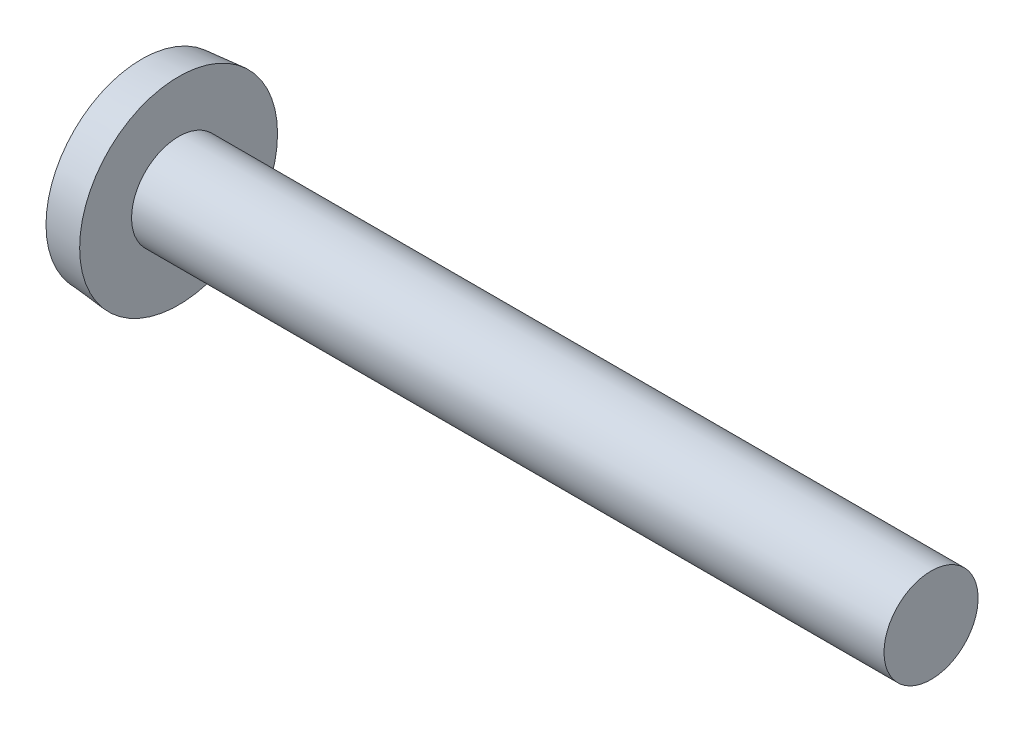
from build123d import *

# Parameters (mm, degrees)
CIRPATTERN1_COUNT = 2
CIRPATTERN1_ANGLE = 90


with BuildPart() as part:
    # BodySke → Base-Revolve (revolve)
    with BuildSketch(Plane.XY, mode=Mode.PRIVATE) as base_revolve_sk:
        with BuildLine():
            Line((1.9812, 1.5875), (1.9812, 3.3401))
            Line((1.9812, 3.3401), (0.7366, 3.231211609))
            ThreePointArc((0.7366, 3.231211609), (0.186482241, 1.657053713), (0, 0))
            Line((0, 0), (27.3812, 0))
            Line((27.3812, 0), (27.3812, 1.5875))
            Line((27.3812, 1.5875), (1.9812, 1.5875))
        make_face()
    revolve(base_revolve_sk.sketch.rotate(Axis((-25.4, 0, 0), (1, 0, 0)), 90), axis=Axis((-25.4, 0, 0), (1, 0, 0)))

    # Sketch3 → Cross section 0
    with BuildSketch(Plane(origin=(0, 0, 0), x_dir=(0, 0, -1), z_dir=(1, 0, 0))):
        with BuildLine():
            Line((-0.4572, 2.1844), (0.4572, 2.1844))
            Line((0.4572, 2.1844), (0.4572, -2.1844))
            Line((0.4572, -2.1844), (-0.4572, -2.1844))
            Line((-0.4572, -2.1844), (-0.4572, 2.1844))
        make_face()
    # Sketch4 → Cross section 1
    with BuildSketch(Plane(origin=(2.4892, 0, 0), x_dir=(0, 0, -1), z_dir=(1, 0, 0))):
        with BuildLine():
            Line((-0.2286, 0.2286), (0.2286, 0.2286))
            Line((0.2286, 0.2286), (0.2286, -0.2286))
            Line((0.2286, -0.2286), (-0.2286, -0.2286))
            Line((-0.2286, -0.2286), (-0.2286, 0.2286))
        make_face()
    cross = loft(mode=Mode.SUBTRACT)

    # CirPattern1: Cross ×2 about axis
    cirpattern1_axis = Axis((0, 0, 0), (1, 0, 0))
    for i in range(1, CIRPATTERN1_COUNT):
        add(cross.rotate(cirpattern1_axis, i * CIRPATTERN1_ANGLE / (CIRPATTERN1_COUNT - 1)), mode=Mode.SUBTRACT)


solid = part.part
